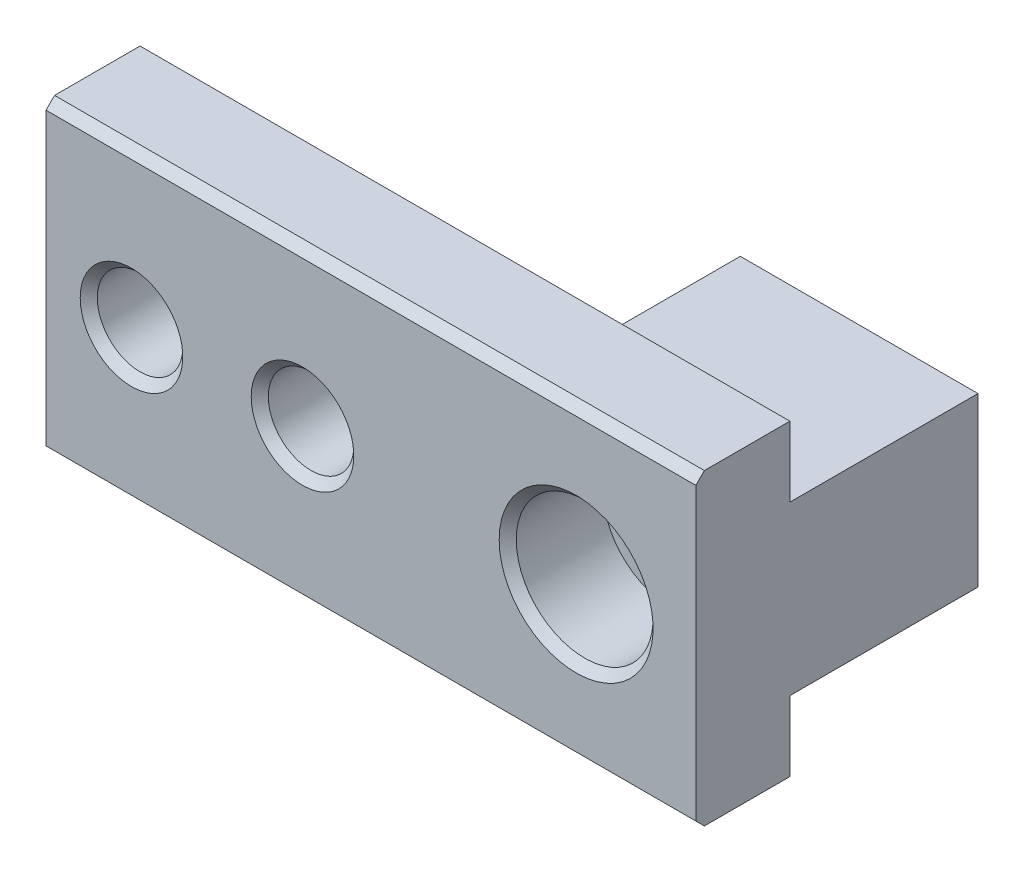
ISO-10303-21;
HEADER;
FILE_DESCRIPTION(('STEP AP214'),'2;1');
FILE_NAME('part.step','',(''),(''),'','','');
FILE_SCHEMA(('AUTOMOTIVE_DESIGN { 1 0 10303 214 1 1 1 1 }'));
ENDSEC;
DATA;
#1=APPLICATION_CONTEXT('core data for automotive mechanical design processes');
#2=APPLICATION_PROTOCOL_DEFINITION('international standard','automotive_design',2000,#1);
#3=PRODUCT_CONTEXT('',#1,'mechanical');
#4=PRODUCT('Part','Part','',(#3));
#5=PRODUCT_RELATED_PRODUCT_CATEGORY('part','',(#4));
#6=PRODUCT_DEFINITION_FORMATION('','',#4);
#7=PRODUCT_DEFINITION_CONTEXT('part definition',#1,'design');
#8=PRODUCT_DEFINITION('design','',#6,#7);
#9=PRODUCT_DEFINITION_SHAPE('','',#8);
#10=(LENGTH_UNIT() NAMED_UNIT(*) SI_UNIT(.MILLI.,.METRE.));
#11=(NAMED_UNIT(*) PLANE_ANGLE_UNIT() SI_UNIT($,.RADIAN.));
#12=(NAMED_UNIT(*) SI_UNIT($,.STERADIAN.) SOLID_ANGLE_UNIT());
#13=UNCERTAINTY_MEASURE_WITH_UNIT(LENGTH_MEASURE(1.E-05),#10,'distance_accuracy_value','');
#14=(GEOMETRIC_REPRESENTATION_CONTEXT(3) GLOBAL_UNCERTAINTY_ASSIGNED_CONTEXT((#13)) GLOBAL_UNIT_ASSIGNED_CONTEXT((#10,
#11,#12)) REPRESENTATION_CONTEXT('',''));
#15=CARTESIAN_POINT('',(0.,0.,0.));
#16=DIRECTION('',(0.,0.,1.));
#17=DIRECTION('',(1.,0.,0.));
#18=AXIS2_PLACEMENT_3D('',#15,#16,#17);
#19=CARTESIAN_POINT('',(0.,0.,-0.0599999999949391));
#20=DIRECTION('',(0.,0.,1.));
#21=DIRECTION('',(-1.,0.,0.));
#22=AXIS2_PLACEMENT_3D('',#19,#20,#21);
#23=CONICAL_SURFACE('',#22,3.02499999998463,1.17809724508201);
#24=CARTESIAN_POINT('',(0.,0.,-0.0703553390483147));
#25=DIRECTION('',(0.,0.,1.));
#26=DIRECTION('',(1.,0.,0.));
#27=AXIS2_PLACEMENT_3D('',#24,#25,#26);
#28=CIRCLE('',#27,3.);
#29=CARTESIAN_POINT('',(3.,0.,-0.0703553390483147));
#30=VERTEX_POINT('',#29);
#31=EDGE_CURVE('E348',#30,#30,#28,.F.);
#32=ORIENTED_EDGE('',*,*,#31,.T.);
#33=EDGE_LOOP('',(#32));
#34=FACE_BOUND('',#33,.T.);
#35=CARTESIAN_POINT('',(0.,0.,-0.059999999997));
#36=DIRECTION('',(0.,0.,1.));
#37=DIRECTION('',(-1.,0.,0.));
#38=AXIS2_PLACEMENT_3D('',#35,#36,#37);
#39=CIRCLE('',#38,3.02499999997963);
#40=CARTESIAN_POINT('',(-3.02499999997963,0.,-0.059999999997));
#41=VERTEX_POINT('',#40);
#42=EDGE_CURVE('E155',#41,#41,#39,.F.);
#43=ORIENTED_EDGE('',*,*,#42,.F.);
#44=EDGE_LOOP('',(#43));
#45=FACE_BOUND('',#44,.T.);
#46=ADVANCED_FACE('F14',(#34,#45),#23,.F.);
#47=CARTESIAN_POINT('',(0.,0.,-0.0599999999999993));
#48=DIRECTION('',(0.,0.,1.));
#49=DIRECTION('',(-1.,0.,0.));
#50=AXIS2_PLACEMENT_3D('',#47,#48,#49);
#51=PLANE('',#50);
#52=CARTESIAN_POINT('',(0.,0.,-0.0599999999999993));
#53=DIRECTION('',(0.,0.,1.));
#54=DIRECTION('',(-1.,0.,0.));
#55=AXIS2_PLACEMENT_3D('',#52,#53,#54);
#56=CIRCLE('',#55,4.);
#57=CARTESIAN_POINT('',(-4.,0.,-0.0599999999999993));
#58=VERTEX_POINT('',#57);
#59=EDGE_CURVE('E146',#58,#58,#56,.T.);
#60=ORIENTED_EDGE('',*,*,#59,.T.);
#61=EDGE_LOOP('',(#60));
#62=FACE_BOUND('',#61,.T.);
#63=ORIENTED_EDGE('',*,*,#42,.T.);
#64=EDGE_LOOP('',(#63));
#65=FACE_BOUND('',#64,.T.);
#66=ADVANCED_FACE('F271',(#62,#65),#51,.T.);
#67=CARTESIAN_POINT('',(0.,0.,-0.0599999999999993));
#68=DIRECTION('',(0.,0.,1.));
#69=DIRECTION('',(-1.,0.,0.));
#70=AXIS2_PLACEMENT_3D('',#67,#68,#69);
#71=CYLINDRICAL_SURFACE('',#70,4.);
#72=CARTESIAN_POINT('',(0.,0.,5.00000000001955));
#73=DIRECTION('',(0.,0.,1.));
#74=DIRECTION('',(-1.,0.,0.));
#75=AXIS2_PLACEMENT_3D('',#72,#73,#74);
#76=CIRCLE('',#75,4.00000000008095);
#77=CARTESIAN_POINT('',(-4.00000000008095,0.,5.00000000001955));
#78=VERTEX_POINT('',#77);
#79=EDGE_CURVE('E126',#78,#78,#76,.T.);
#80=ORIENTED_EDGE('',*,*,#79,.T.);
#81=EDGE_LOOP('',(#80));
#82=FACE_BOUND('',#81,.T.);
#83=ORIENTED_EDGE('',*,*,#59,.F.);
#84=EDGE_LOOP('',(#83));
#85=FACE_BOUND('',#84,.T.);
#86=ADVANCED_FACE('F267',(#82,#85),#71,.F.);
#87=CARTESIAN_POINT('',(-7.1,4.9,-11.));
#88=DIRECTION('',(0.,0.,1.));
#89=DIRECTION('',(-1.,0.,0.));
#90=AXIS2_PLACEMENT_3D('',#87,#88,#89);
#91=PLANE('',#90);
#92=CARTESIAN_POINT('',(0.,0.,-11.));
#93=DIRECTION('',(0.,0.,1.));
#94=DIRECTION('',(1.,0.,0.));
#95=AXIS2_PLACEMENT_3D('',#92,#93,#94);
#96=CIRCLE('',#95,3.51035533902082);
#97=CARTESIAN_POINT('',(3.51035533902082,0.,-11.));
#98=VERTEX_POINT('',#97);
#99=EDGE_CURVE('E189',#98,#98,#96,.T.);
#100=ORIENTED_EDGE('',*,*,#99,.T.);
#101=EDGE_LOOP('',(#100));
#102=FACE_BOUND('',#101,.T.);
#103=DIRECTION('',(-1.,0.,0.));
#104=VECTOR('',#103,1.);
#105=CARTESIAN_POINT('',(-7.1,-4.9,-11.));
#106=LINE('',#105,#104);
#107=CARTESIAN_POINT('',(7.,-4.9,-11.));
#108=VERTEX_POINT('',#107);
#109=CARTESIAN_POINT('',(-6.9,-4.9,-11.));
#110=VERTEX_POINT('',#109);
#111=EDGE_CURVE('E137',#108,#110,#106,.T.);
#112=ORIENTED_EDGE('',*,*,#111,.T.);
#113=DIRECTION('',(0.,-1.,0.));
#114=VECTOR('',#113,1.);
#115=CARTESIAN_POINT('',(-6.9,10.8813880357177,-11.));
#116=LINE('',#115,#114);
#117=CARTESIAN_POINT('',(-6.9,4.9,-11.));
#118=VERTEX_POINT('',#117);
#119=EDGE_CURVE('E315',#118,#110,#116,.T.);
#120=ORIENTED_EDGE('',*,*,#119,.F.);
#121=DIRECTION('',(1.,0.,0.));
#122=VECTOR('',#121,1.);
#123=CARTESIAN_POINT('',(-7.1,4.9,-11.));
#124=LINE('',#123,#122);
#125=CARTESIAN_POINT('',(7.,4.9,-11.));
#126=VERTEX_POINT('',#125);
#127=EDGE_CURVE('E142',#118,#126,#124,.T.);
#128=ORIENTED_EDGE('',*,*,#127,.T.);
#129=DIRECTION('',(0.,1.,0.));
#130=VECTOR('',#129,1.);
#131=CARTESIAN_POINT('',(7.,4.9,-11.));
#132=LINE('',#131,#130);
#133=EDGE_CURVE('E128',#108,#126,#132,.T.);
#134=ORIENTED_EDGE('',*,*,#133,.F.);
#135=EDGE_LOOP('',(#112,#120,#128,#134));
#136=FACE_BOUND('',#135,.T.);
#137=ADVANCED_FACE('F263',(#102,#136),#91,.F.);
#138=CARTESIAN_POINT('',(-7.1,9.05,0.));
#139=DIRECTION('',(0.,0.,1.));
#140=DIRECTION('',(-1.,0.,0.));
#141=AXIS2_PLACEMENT_3D('',#138,#139,#140);
#142=PLANE('',#141);
#143=DIRECTION('',(0.,1.,0.));
#144=VECTOR('',#143,1.);
#145=CARTESIAN_POINT('',(-31.,9.05,0.));
#146=LINE('',#145,#144);
#147=CARTESIAN_POINT('',(-31.,4.9,0.));
#148=VERTEX_POINT('',#147);
#149=CARTESIAN_POINT('',(-31.,9.,0.));
#150=VERTEX_POINT('',#149);
#151=EDGE_CURVE('E331',#148,#150,#146,.T.);
#152=ORIENTED_EDGE('',*,*,#151,.T.);
#153=DIRECTION('',(1.,0.,0.));
#154=VECTOR('',#153,1.);
#155=CARTESIAN_POINT('',(-7.1,9.,0.));
#156=LINE('',#155,#154);
#157=CARTESIAN_POINT('',(7.,9.,0.));
#158=VERTEX_POINT('',#157);
#159=EDGE_CURVE('E351',#150,#158,#156,.T.);
#160=ORIENTED_EDGE('',*,*,#159,.T.);
#161=DIRECTION('',(0.,1.,0.));
#162=VECTOR('',#161,1.);
#163=CARTESIAN_POINT('',(7.,4.9,0.));
#164=LINE('',#163,#162);
#165=CARTESIAN_POINT('',(7.,4.9,0.));
#166=VERTEX_POINT('',#165);
#167=EDGE_CURVE('E152',#166,#158,#164,.T.);
#168=ORIENTED_EDGE('',*,*,#167,.F.);
#169=DIRECTION('',(1.,0.,0.));
#170=VECTOR('',#169,1.);
#171=CARTESIAN_POINT('',(-7.1,4.9,0.));
#172=LINE('',#171,#170);
#173=EDGE_CURVE('E144',#166,#148,#172,.F.);
#174=ORIENTED_EDGE('',*,*,#173,.T.);
#175=EDGE_LOOP('',(#152,#160,#168,#174));
#176=FACE_BOUND('',#175,.T.);
#177=ADVANCED_FACE('F259',(#176),#142,.F.);
#178=CARTESIAN_POINT('',(-7.1,4.9,-11.));
#179=DIRECTION('',(0.,-1.,0.));
#180=DIRECTION('',(1.,0.,0.));
#181=AXIS2_PLACEMENT_3D('',#178,#179,#180);
#182=PLANE('',#181);
#183=DIRECTION('',(0.,0.,1.));
#184=VECTOR('',#183,1.);
#185=CARTESIAN_POINT('',(-6.9,4.9,-11.));
#186=LINE('',#185,#184);
#187=CARTESIAN_POINT('',(-6.9,4.9,-2.5));
#188=VERTEX_POINT('',#187);
#189=EDGE_CURVE('E342',#118,#188,#186,.T.);
#190=ORIENTED_EDGE('',*,*,#189,.T.);
#191=DIRECTION('',(-1.,0.,0.));
#192=VECTOR('',#191,1.);
#193=CARTESIAN_POINT('',(-31.1,4.9,-2.5));
#194=LINE('',#193,#192);
#195=CARTESIAN_POINT('',(-31.,4.9,-2.5));
#196=VERTEX_POINT('',#195);
#197=EDGE_CURVE('E140',#188,#196,#194,.T.);
#198=ORIENTED_EDGE('',*,*,#197,.T.);
#199=DIRECTION('',(0.,0.,1.));
#200=VECTOR('',#199,1.);
#201=CARTESIAN_POINT('',(-31.,4.9,-11.));
#202=LINE('',#201,#200);
#203=EDGE_CURVE('E158',#196,#148,#202,.T.);
#204=ORIENTED_EDGE('',*,*,#203,.T.);
#205=ORIENTED_EDGE('',*,*,#173,.F.);
#206=DIRECTION('',(0.,0.,1.));
#207=VECTOR('',#206,1.);
#208=CARTESIAN_POINT('',(7.,4.9,-11.));
#209=LINE('',#208,#207);
#210=EDGE_CURVE('E322',#126,#166,#209,.T.);
#211=ORIENTED_EDGE('',*,*,#210,.F.);
#212=ORIENTED_EDGE('',*,*,#127,.F.);
#213=EDGE_LOOP('',(#190,#198,#204,#205,#211,#212));
#214=FACE_BOUND('',#213,.T.);
#215=ADVANCED_FACE('F255',(#214),#182,.F.);
#216=CARTESIAN_POINT('',(-31.1,4.9,-2.5));
#217=DIRECTION('',(0.,0.,1.));
#218=DIRECTION('',(-1.,0.,0.));
#219=AXIS2_PLACEMENT_3D('',#216,#217,#218);
#220=PLANE('',#219);
#221=CARTESIAN_POINT('',(-16.,0.,-2.5));
#222=DIRECTION('',(0.,0.,1.));
#223=DIRECTION('',(1.,0.,0.));
#224=AXIS2_PLACEMENT_3D('',#221,#222,#223);
#225=CIRCLE('',#224,3.);
#226=CARTESIAN_POINT('',(-13.,0.,-2.5));
#227=VERTEX_POINT('',#226);
#228=EDGE_CURVE('E165',#227,#227,#225,.T.);
#229=ORIENTED_EDGE('',*,*,#228,.T.);
#230=EDGE_LOOP('',(#229));
#231=FACE_BOUND('',#230,.T.);
#232=CARTESIAN_POINT('',(-26.,0.,-2.5));
#233=DIRECTION('',(0.,0.,1.));
#234=DIRECTION('',(1.,0.,0.));
#235=AXIS2_PLACEMENT_3D('',#232,#233,#234);
#236=CIRCLE('',#235,3.);
#237=CARTESIAN_POINT('',(-23.,0.,-2.5));
#238=VERTEX_POINT('',#237);
#239=EDGE_CURVE('E162',#238,#238,#236,.T.);
#240=ORIENTED_EDGE('',*,*,#239,.T.);
#241=EDGE_LOOP('',(#240));
#242=FACE_BOUND('',#241,.T.);
#243=DIRECTION('',(0.,-1.,0.));
#244=VECTOR('',#243,1.);
#245=CARTESIAN_POINT('',(-31.,12.1632253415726,-2.5));
#246=LINE('',#245,#244);
#247=CARTESIAN_POINT('',(-31.,-4.9,-2.5));
#248=VERTEX_POINT('',#247);
#249=EDGE_CURVE('E339',#196,#248,#246,.T.);
#250=ORIENTED_EDGE('',*,*,#249,.F.);
#251=ORIENTED_EDGE('',*,*,#197,.F.);
#252=DIRECTION('',(0.,-1.,0.));
#253=VECTOR('',#252,1.);
#254=CARTESIAN_POINT('',(-6.9,10.8813880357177,-2.5));
#255=LINE('',#254,#253);
#256=CARTESIAN_POINT('',(-6.9,-4.9,-2.5));
#257=VERTEX_POINT('',#256);
#258=EDGE_CURVE('E344',#188,#257,#255,.T.);
#259=ORIENTED_EDGE('',*,*,#258,.T.);
#260=DIRECTION('',(-1.,0.,0.));
#261=VECTOR('',#260,1.);
#262=CARTESIAN_POINT('',(-7.1,-4.9,-2.5));
#263=LINE('',#262,#261);
#264=EDGE_CURVE('E135',#257,#248,#263,.T.);
#265=ORIENTED_EDGE('',*,*,#264,.T.);
#266=EDGE_LOOP('',(#250,#251,#259,#265));
#267=FACE_BOUND('',#266,.T.);
#268=ADVANCED_FACE('F251',(#231,#242,#267),#220,.F.);
#269=CARTESIAN_POINT('',(-7.1,-4.9,-11.));
#270=DIRECTION('',(0.,1.,0.));
#271=DIRECTION('',(-1.,0.,0.));
#272=AXIS2_PLACEMENT_3D('',#269,#270,#271);
#273=PLANE('',#272);
#274=ORIENTED_EDGE('',*,*,#264,.F.);
#275=DIRECTION('',(0.,0.,-1.));
#276=VECTOR('',#275,1.);
#277=CARTESIAN_POINT('',(-6.9,-4.9,-11.));
#278=LINE('',#277,#276);
#279=EDGE_CURVE('E186',#257,#110,#278,.T.);
#280=ORIENTED_EDGE('',*,*,#279,.T.);
#281=ORIENTED_EDGE('',*,*,#111,.F.);
#282=DIRECTION('',(0.,0.,1.));
#283=VECTOR('',#282,1.);
#284=CARTESIAN_POINT('',(7.,-4.9,-11.));
#285=LINE('',#284,#283);
#286=CARTESIAN_POINT('',(7.,-4.9,0.));
#287=VERTEX_POINT('',#286);
#288=EDGE_CURVE('E125',#287,#108,#285,.F.);
#289=ORIENTED_EDGE('',*,*,#288,.F.);
#290=DIRECTION('',(-1.,0.,0.));
#291=VECTOR('',#290,1.);
#292=CARTESIAN_POINT('',(-7.1,-4.9,0.));
#293=LINE('',#292,#291);
#294=CARTESIAN_POINT('',(-31.,-4.9,0.));
#295=VERTEX_POINT('',#294);
#296=EDGE_CURVE('E123',#287,#295,#293,.T.);
#297=ORIENTED_EDGE('',*,*,#296,.T.);
#298=DIRECTION('',(0.,0.,-1.));
#299=VECTOR('',#298,1.);
#300=CARTESIAN_POINT('',(-31.,-4.9,-11.));
#301=LINE('',#300,#299);
#302=EDGE_CURVE('E334',#295,#248,#301,.T.);
#303=ORIENTED_EDGE('',*,*,#302,.T.);
#304=EDGE_LOOP('',(#274,#280,#281,#289,#297,#303));
#305=FACE_BOUND('',#304,.T.);
#306=ADVANCED_FACE('F248',(#305),#273,.F.);
#307=CARTESIAN_POINT('',(-7.1,-4.9,0.));
#308=DIRECTION('',(0.,0.,1.));
#309=DIRECTION('',(-1.,0.,0.));
#310=AXIS2_PLACEMENT_3D('',#307,#308,#309);
#311=PLANE('',#310);
#312=ORIENTED_EDGE('',*,*,#296,.F.);
#313=DIRECTION('',(0.,1.,0.));
#314=VECTOR('',#313,1.);
#315=CARTESIAN_POINT('',(7.,4.9,0.));
#316=LINE('',#315,#314);
#317=CARTESIAN_POINT('',(7.,-9.,0.));
#318=VERTEX_POINT('',#317);
#319=EDGE_CURVE('E117',#318,#287,#316,.T.);
#320=ORIENTED_EDGE('',*,*,#319,.F.);
#321=DIRECTION('',(-1.,0.,0.));
#322=VECTOR('',#321,1.);
#323=CARTESIAN_POINT('',(-7.1,-9.,0.));
#324=LINE('',#323,#322);
#325=CARTESIAN_POINT('',(-31.,-9.,0.));
#326=VERTEX_POINT('',#325);
#327=EDGE_CURVE('E103',#318,#326,#324,.T.);
#328=ORIENTED_EDGE('',*,*,#327,.T.);
#329=DIRECTION('',(0.,1.,0.));
#330=VECTOR('',#329,1.);
#331=CARTESIAN_POINT('',(-31.,-4.9,0.));
#332=LINE('',#331,#330);
#333=EDGE_CURVE('E337',#326,#295,#332,.T.);
#334=ORIENTED_EDGE('',*,*,#333,.T.);
#335=EDGE_LOOP('',(#312,#320,#328,#334));
#336=FACE_BOUND('',#335,.T.);
#337=ADVANCED_FACE('F121',(#336),#311,.F.);
#338=CARTESIAN_POINT('',(0.,0.,5.4999999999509));
#339=DIRECTION('',(0.,0.,1.));
#340=DIRECTION('',(-1.,0.,0.));
#341=AXIS2_PLACEMENT_3D('',#338,#339,#340);
#342=CONICAL_SURFACE('',#341,4.50000000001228,0.785398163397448);
#343=CARTESIAN_POINT('',(0.,0.,5.4999999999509));
#344=DIRECTION('',(0.,0.,1.));
#345=DIRECTION('',(-1.,0.,0.));
#346=AXIS2_PLACEMENT_3D('',#343,#344,#345);
#347=CIRCLE('',#346,4.50000000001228);
#348=CARTESIAN_POINT('',(-4.50000000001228,0.,5.4999999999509));
#349=VERTEX_POINT('',#348);
#350=EDGE_CURVE('E148',#349,#349,#347,.T.);
#351=ORIENTED_EDGE('',*,*,#350,.T.);
#352=EDGE_LOOP('',(#351));
#353=FACE_BOUND('',#352,.T.);
#354=ORIENTED_EDGE('',*,*,#79,.F.);
#355=EDGE_LOOP('',(#354));
#356=FACE_BOUND('',#355,.T.);
#357=ADVANCED_FACE('F238',(#353,#356),#342,.F.);
#358=CARTESIAN_POINT('',(7.,4.9,-11.));
#359=DIRECTION('',(1.,0.,0.));
#360=DIRECTION('',(0.,1.,0.));
#361=AXIS2_PLACEMENT_3D('',#358,#359,#360);
#362=PLANE('',#361);
#363=DIRECTION('',(0.,-1.,0.));
#364=VECTOR('',#363,1.);
#365=CARTESIAN_POINT('',(7.,9.05,5.5));
#366=LINE('',#365,#364);
#367=CARTESIAN_POINT('',(7.,8.5,5.5));
#368=VERTEX_POINT('',#367);
#369=CARTESIAN_POINT('',(7.,-8.5,5.5));
#370=VERTEX_POINT('',#369);
#371=EDGE_CURVE('E151',#368,#370,#366,.T.);
#372=ORIENTED_EDGE('',*,*,#371,.T.);
#373=DIRECTION('',(0.,0.707106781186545,0.70710678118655));
#374=VECTOR('',#373,1.);
#375=CARTESIAN_POINT('',(7.,-10.05,3.94999999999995));
#376=LINE('',#375,#374);
#377=CARTESIAN_POINT('',(7.,-9.,5.));
#378=VERTEX_POINT('',#377);
#379=EDGE_CURVE('E119',#370,#378,#376,.F.);
#380=ORIENTED_EDGE('',*,*,#379,.T.);
#381=DIRECTION('',(0.,0.,1.));
#382=VECTOR('',#381,1.);
#383=CARTESIAN_POINT('',(7.,-9.,6.90252950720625));
#384=LINE('',#383,#382);
#385=EDGE_CURVE('E106',#318,#378,#384,.T.);
#386=ORIENTED_EDGE('',*,*,#385,.F.);
#387=ORIENTED_EDGE('',*,*,#319,.T.);
#388=ORIENTED_EDGE('',*,*,#288,.T.);
#389=ORIENTED_EDGE('',*,*,#133,.T.);
#390=ORIENTED_EDGE('',*,*,#210,.T.);
#391=ORIENTED_EDGE('',*,*,#167,.T.);
#392=DIRECTION('',(0.,0.,-1.));
#393=VECTOR('',#392,1.);
#394=CARTESIAN_POINT('',(7.,9.,5.74816269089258));
#395=LINE('',#394,#393);
#396=CARTESIAN_POINT('',(7.,9.,5.));
#397=VERTEX_POINT('',#396);
#398=EDGE_CURVE('E111',#397,#158,#395,.T.);
#399=ORIENTED_EDGE('',*,*,#398,.F.);
#400=DIRECTION('',(0.,0.707106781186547,-0.707106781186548));
#401=VECTOR('',#400,1.);
#402=CARTESIAN_POINT('',(7.,14.95,-0.95));
#403=LINE('',#402,#401);
#404=EDGE_CURVE('E203',#397,#368,#403,.F.);
#405=ORIENTED_EDGE('',*,*,#404,.T.);
#406=EDGE_LOOP('',(#372,#380,#386,#387,#388,#389,#390,#391,#399,#405));
#407=FACE_BOUND('',#406,.T.);
#408=ADVANCED_FACE('F115',(#407),#362,.T.);
#409=CARTESIAN_POINT('',(-7.1,9.05,5.5));
#410=DIRECTION('',(0.,0.,-1.));
#411=DIRECTION('',(1.,0.,0.));
#412=AXIS2_PLACEMENT_3D('',#409,#410,#411);
#413=PLANE('',#412);
#414=CARTESIAN_POINT('',(-16.,0.,5.5));
#415=DIRECTION('',(0.,0.,-1.));
#416=DIRECTION('',(-1.,0.,0.));
#417=AXIS2_PLACEMENT_3D('',#414,#415,#416);
#418=CIRCLE('',#417,3.);
#419=CARTESIAN_POINT('',(-19.,0.,5.5));
#420=VERTEX_POINT('',#419);
#421=EDGE_CURVE('E177',#420,#420,#418,.T.);
#422=ORIENTED_EDGE('',*,*,#421,.T.);
#423=EDGE_LOOP('',(#422));
#424=FACE_BOUND('',#423,.T.);
#425=CARTESIAN_POINT('',(-26.,0.,5.5));
#426=DIRECTION('',(0.,0.,-1.));
#427=DIRECTION('',(-1.,0.,0.));
#428=AXIS2_PLACEMENT_3D('',#425,#426,#427);
#429=CIRCLE('',#428,3.);
#430=CARTESIAN_POINT('',(-29.,0.,5.5));
#431=VERTEX_POINT('',#430);
#432=EDGE_CURVE('E174',#431,#431,#429,.T.);
#433=ORIENTED_EDGE('',*,*,#432,.T.);
#434=EDGE_LOOP('',(#433));
#435=FACE_BOUND('',#434,.T.);
#436=DIRECTION('',(0.,-1.,0.));
#437=VECTOR('',#436,1.);
#438=CARTESIAN_POINT('',(-31.,9.05,5.5));
#439=LINE('',#438,#437);
#440=CARTESIAN_POINT('',(-31.,8.5,5.5));
#441=VERTEX_POINT('',#440);
#442=CARTESIAN_POINT('',(-31.,-8.5,5.5));
#443=VERTEX_POINT('',#442);
#444=EDGE_CURVE('E159',#441,#443,#439,.T.);
#445=ORIENTED_EDGE('',*,*,#444,.T.);
#446=DIRECTION('',(1.,0.,0.));
#447=VECTOR('',#446,1.);
#448=CARTESIAN_POINT('',(-7.1,-8.5,5.5));
#449=LINE('',#448,#447);
#450=EDGE_CURVE('E200',#443,#370,#449,.T.);
#451=ORIENTED_EDGE('',*,*,#450,.T.);
#452=ORIENTED_EDGE('',*,*,#371,.F.);
#453=DIRECTION('',(-1.,0.,0.));
#454=VECTOR('',#453,1.);
#455=CARTESIAN_POINT('',(-7.1,8.5,5.5));
#456=LINE('',#455,#454);
#457=EDGE_CURVE('E198',#368,#441,#456,.T.);
#458=ORIENTED_EDGE('',*,*,#457,.T.);
#459=EDGE_LOOP('',(#445,#451,#452,#458));
#460=FACE_BOUND('',#459,.T.);
#461=ORIENTED_EDGE('',*,*,#350,.F.);
#462=EDGE_LOOP('',(#461));
#463=FACE_BOUND('',#462,.T.);
#464=ADVANCED_FACE('F212',(#424,#435,#460,#463),#413,.F.);
#465=CARTESIAN_POINT('',(-31.,12.1632253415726,7.5));
#466=DIRECTION('',(1.,0.,0.));
#467=DIRECTION('',(0.,1.,0.));
#468=AXIS2_PLACEMENT_3D('',#465,#466,#467);
#469=PLANE('',#468);
#470=DIRECTION('',(0.,0.,1.));
#471=VECTOR('',#470,1.);
#472=CARTESIAN_POINT('',(-31.,-9.,7.5));
#473=LINE('',#472,#471);
#474=CARTESIAN_POINT('',(-31.,-9.,5.));
#475=VERTEX_POINT('',#474);
#476=EDGE_CURVE('E107',#326,#475,#473,.T.);
#477=ORIENTED_EDGE('',*,*,#476,.T.);
#478=DIRECTION('',(0.,-0.707106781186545,-0.70710678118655));
#479=VECTOR('',#478,1.);
#480=CARTESIAN_POINT('',(-31.,-8.5,5.5));
#481=LINE('',#480,#479);
#482=EDGE_CURVE('E22',#475,#443,#481,.F.);
#483=ORIENTED_EDGE('',*,*,#482,.T.);
#484=ORIENTED_EDGE('',*,*,#444,.F.);
#485=DIRECTION('',(0.,-0.707106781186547,0.707106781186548));
#486=VECTOR('',#485,1.);
#487=CARTESIAN_POINT('',(-31.,9.,5.));
#488=LINE('',#487,#486);
#489=CARTESIAN_POINT('',(-31.,9.,5.));
#490=VERTEX_POINT('',#489);
#491=EDGE_CURVE('E29',#441,#490,#488,.F.);
#492=ORIENTED_EDGE('',*,*,#491,.T.);
#493=DIRECTION('',(0.,0.,-1.));
#494=VECTOR('',#493,1.);
#495=CARTESIAN_POINT('',(-31.,9.,7.5));
#496=LINE('',#495,#494);
#497=EDGE_CURVE('E195',#490,#150,#496,.T.);
#498=ORIENTED_EDGE('',*,*,#497,.T.);
#499=ORIENTED_EDGE('',*,*,#151,.F.);
#500=ORIENTED_EDGE('',*,*,#203,.F.);
#501=ORIENTED_EDGE('',*,*,#249,.T.);
#502=ORIENTED_EDGE('',*,*,#302,.F.);
#503=ORIENTED_EDGE('',*,*,#333,.F.);
#504=EDGE_LOOP('',(#477,#483,#484,#492,#498,#499,#500,#501,#502,#503));
#505=FACE_BOUND('',#504,.T.);
#506=ADVANCED_FACE('F208',(#505),#469,.F.);
#507=CARTESIAN_POINT('',(-26.,0.,-4.5));
#508=DIRECTION('',(0.,0.,1.));
#509=DIRECTION('',(1.,0.,0.));
#510=AXIS2_PLACEMENT_3D('',#507,#508,#509);
#511=CYLINDRICAL_SURFACE('',#510,2.5);
#512=CARTESIAN_POINT('',(-26.,0.,-2.));
#513=DIRECTION('',(0.,0.,1.));
#514=DIRECTION('',(1.,0.,0.));
#515=AXIS2_PLACEMENT_3D('',#512,#513,#514);
#516=CIRCLE('',#515,2.5);
#517=CARTESIAN_POINT('',(-23.5,0.,-2.));
#518=VERTEX_POINT('',#517);
#519=EDGE_CURVE('E183',#518,#518,#516,.F.);
#520=ORIENTED_EDGE('',*,*,#519,.T.);
#521=EDGE_LOOP('',(#520));
#522=FACE_BOUND('',#521,.T.);
#523=CARTESIAN_POINT('',(-26.,0.,5.));
#524=DIRECTION('',(0.,0.,-1.));
#525=DIRECTION('',(-1.,0.,0.));
#526=AXIS2_PLACEMENT_3D('',#523,#524,#525);
#527=CIRCLE('',#526,2.5);
#528=CARTESIAN_POINT('',(-28.5,0.,5.));
#529=VERTEX_POINT('',#528);
#530=EDGE_CURVE('E180',#529,#529,#527,.F.);
#531=ORIENTED_EDGE('',*,*,#530,.T.);
#532=EDGE_LOOP('',(#531));
#533=FACE_BOUND('',#532,.T.);
#534=ADVANCED_FACE('F236',(#522,#533),#511,.F.);
#535=CARTESIAN_POINT('',(-16.,0.,-4.5));
#536=DIRECTION('',(0.,0.,1.));
#537=DIRECTION('',(1.,0.,0.));
#538=AXIS2_PLACEMENT_3D('',#535,#536,#537);
#539=CYLINDRICAL_SURFACE('',#538,2.5);
#540=CARTESIAN_POINT('',(-16.,0.,-2.));
#541=DIRECTION('',(0.,0.,1.));
#542=DIRECTION('',(1.,0.,0.));
#543=AXIS2_PLACEMENT_3D('',#540,#541,#542);
#544=CIRCLE('',#543,2.5);
#545=CARTESIAN_POINT('',(-13.5,0.,-2.));
#546=VERTEX_POINT('',#545);
#547=EDGE_CURVE('E171',#546,#546,#544,.F.);
#548=ORIENTED_EDGE('',*,*,#547,.T.);
#549=EDGE_LOOP('',(#548));
#550=FACE_BOUND('',#549,.T.);
#551=CARTESIAN_POINT('',(-16.,0.,5.));
#552=DIRECTION('',(0.,0.,-1.));
#553=DIRECTION('',(-1.,0.,0.));
#554=AXIS2_PLACEMENT_3D('',#551,#552,#553);
#555=CIRCLE('',#554,2.5);
#556=CARTESIAN_POINT('',(-18.5,0.,5.));
#557=VERTEX_POINT('',#556);
#558=EDGE_CURVE('E168',#557,#557,#555,.F.);
#559=ORIENTED_EDGE('',*,*,#558,.T.);
#560=EDGE_LOOP('',(#559));
#561=FACE_BOUND('',#560,.T.);
#562=ADVANCED_FACE('F283',(#550,#561),#539,.F.);
#563=CARTESIAN_POINT('',(-16.,0.,-2.5));
#564=DIRECTION('',(0.,0.,-1.));
#565=DIRECTION('',(-1.,0.,0.));
#566=AXIS2_PLACEMENT_3D('',#563,#564,#565);
#567=CONICAL_SURFACE('',#566,3.,0.785398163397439);
#568=ORIENTED_EDGE('',*,*,#547,.F.);
#569=EDGE_LOOP('',(#568));
#570=FACE_BOUND('',#569,.T.);
#571=ORIENTED_EDGE('',*,*,#228,.F.);
#572=EDGE_LOOP('',(#571));
#573=FACE_BOUND('',#572,.T.);
#574=ADVANCED_FACE('F279',(#570,#573),#567,.F.);
#575=CARTESIAN_POINT('',(-16.,0.,5.));
#576=DIRECTION('',(0.,0.,1.));
#577=DIRECTION('',(1.,0.,0.));
#578=AXIS2_PLACEMENT_3D('',#575,#576,#577);
#579=CONICAL_SURFACE('',#578,2.5,0.785398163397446);
#580=ORIENTED_EDGE('',*,*,#421,.F.);
#581=EDGE_LOOP('',(#580));
#582=FACE_BOUND('',#581,.T.);
#583=ORIENTED_EDGE('',*,*,#558,.F.);
#584=EDGE_LOOP('',(#583));
#585=FACE_BOUND('',#584,.T.);
#586=ADVANCED_FACE('F282',(#582,#585),#579,.F.);
#587=CARTESIAN_POINT('',(-26.,0.,-2.5));
#588=DIRECTION('',(0.,0.,-1.));
#589=DIRECTION('',(-1.,0.,0.));
#590=AXIS2_PLACEMENT_3D('',#587,#588,#589);
#591=CONICAL_SURFACE('',#590,3.,0.785398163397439);
#592=ORIENTED_EDGE('',*,*,#519,.F.);
#593=EDGE_LOOP('',(#592));
#594=FACE_BOUND('',#593,.T.);
#595=ORIENTED_EDGE('',*,*,#239,.F.);
#596=EDGE_LOOP('',(#595));
#597=FACE_BOUND('',#596,.T.);
#598=ADVANCED_FACE('F287',(#594,#597),#591,.F.);
#599=CARTESIAN_POINT('',(-26.,0.,5.));
#600=DIRECTION('',(0.,0.,1.));
#601=DIRECTION('',(1.,0.,0.));
#602=AXIS2_PLACEMENT_3D('',#599,#600,#601);
#603=CONICAL_SURFACE('',#602,2.5,0.785398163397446);
#604=ORIENTED_EDGE('',*,*,#432,.F.);
#605=EDGE_LOOP('',(#604));
#606=FACE_BOUND('',#605,.T.);
#607=ORIENTED_EDGE('',*,*,#530,.F.);
#608=EDGE_LOOP('',(#607));
#609=FACE_BOUND('',#608,.T.);
#610=ADVANCED_FACE('F291',(#606,#609),#603,.F.);
#611=CARTESIAN_POINT('',(-6.9,10.8813880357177,22.3659492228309));
#612=DIRECTION('',(1.,0.,0.));
#613=DIRECTION('',(0.,1.,0.));
#614=AXIS2_PLACEMENT_3D('',#611,#612,#613);
#615=PLANE('',#614);
#616=ORIENTED_EDGE('',*,*,#119,.T.);
#617=ORIENTED_EDGE('',*,*,#279,.F.);
#618=ORIENTED_EDGE('',*,*,#258,.F.);
#619=ORIENTED_EDGE('',*,*,#189,.F.);
#620=EDGE_LOOP('',(#616,#617,#618,#619));
#621=FACE_BOUND('',#620,.T.);
#622=ADVANCED_FACE('F294',(#621),#615,.F.);
#623=CARTESIAN_POINT('',(0.,0.,5.5));
#624=DIRECTION('',(0.,0.,-1.));
#625=DIRECTION('',(-1.,0.,0.));
#626=AXIS2_PLACEMENT_3D('',#623,#624,#625);
#627=CYLINDRICAL_SURFACE('',#626,3.);
#628=CARTESIAN_POINT('',(0.,0.,-10.4896446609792));
#629=DIRECTION('',(0.,0.,1.));
#630=DIRECTION('',(1.,0.,0.));
#631=AXIS2_PLACEMENT_3D('',#628,#629,#630);
#632=CIRCLE('',#631,3.);
#633=CARTESIAN_POINT('',(3.,0.,-10.4896446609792));
#634=VERTEX_POINT('',#633);
#635=EDGE_CURVE('E192',#634,#634,#632,.F.);
#636=ORIENTED_EDGE('',*,*,#635,.T.);
#637=EDGE_LOOP('',(#636));
#638=FACE_BOUND('',#637,.T.);
#639=ORIENTED_EDGE('',*,*,#31,.F.);
#640=EDGE_LOOP('',(#639));
#641=FACE_BOUND('',#640,.T.);
#642=ADVANCED_FACE('F298',(#638,#641),#627,.F.);
#643=CARTESIAN_POINT('',(0.,0.,-11.3431980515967));
#644=DIRECTION('',(0.,0.,-1.));
#645=DIRECTION('',(-1.,0.,0.));
#646=AXIS2_PLACEMENT_3D('',#643,#644,#645);
#647=CONICAL_SURFACE('',#646,3.85355339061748,0.785398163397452);
#648=ORIENTED_EDGE('',*,*,#635,.F.);
#649=EDGE_LOOP('',(#648));
#650=FACE_BOUND('',#649,.T.);
#651=ORIENTED_EDGE('',*,*,#99,.F.);
#652=EDGE_LOOP('',(#651));
#653=FACE_BOUND('',#652,.T.);
#654=ADVANCED_FACE('F296',(#650,#653),#647,.F.);
#655=CARTESIAN_POINT('',(-31.,9.,5.74816269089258));
#656=DIRECTION('',(0.,-1.,0.));
#657=DIRECTION('',(1.,0.,0.));
#658=AXIS2_PLACEMENT_3D('',#655,#656,#657);
#659=PLANE('',#658);
#660=ORIENTED_EDGE('',*,*,#497,.F.);
#661=DIRECTION('',(1.,0.,0.));
#662=VECTOR('',#661,1.);
#663=CARTESIAN_POINT('',(-31.,9.,5.));
#664=LINE('',#663,#662);
#665=EDGE_CURVE('E9',#490,#397,#664,.T.);
#666=ORIENTED_EDGE('',*,*,#665,.T.);
#667=ORIENTED_EDGE('',*,*,#398,.T.);
#668=ORIENTED_EDGE('',*,*,#159,.F.);
#669=EDGE_LOOP('',(#660,#666,#667,#668));
#670=FACE_BOUND('',#669,.T.);
#671=ADVANCED_FACE('F225',(#670),#659,.F.);
#672=CARTESIAN_POINT('',(-31.,-9.,6.90252950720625));
#673=DIRECTION('',(0.,1.,0.));
#674=DIRECTION('',(-1.,0.,0.));
#675=AXIS2_PLACEMENT_3D('',#672,#673,#674);
#676=PLANE('',#675);
#677=ORIENTED_EDGE('',*,*,#385,.T.);
#678=DIRECTION('',(-1.,0.,0.));
#679=VECTOR('',#678,1.);
#680=CARTESIAN_POINT('',(-31.,-9.,5.));
#681=LINE('',#680,#679);
#682=EDGE_CURVE('E37',#378,#475,#681,.T.);
#683=ORIENTED_EDGE('',*,*,#682,.T.);
#684=ORIENTED_EDGE('',*,*,#476,.F.);
#685=ORIENTED_EDGE('',*,*,#327,.F.);
#686=EDGE_LOOP('',(#677,#683,#684,#685));
#687=FACE_BOUND('',#686,.T.);
#688=ADVANCED_FACE('F105',(#687),#676,.F.);
#689=CARTESIAN_POINT('',(-7.1,-8.5,5.5));
#690=DIRECTION('',(0.,0.70710678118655,-0.707106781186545));
#691=DIRECTION('',(1.,0.,0.));
#692=AXIS2_PLACEMENT_3D('',#689,#690,#691);
#693=PLANE('',#692);
#694=ORIENTED_EDGE('',*,*,#482,.F.);
#695=ORIENTED_EDGE('',*,*,#682,.F.);
#696=ORIENTED_EDGE('',*,*,#379,.F.);
#697=ORIENTED_EDGE('',*,*,#450,.F.);
#698=EDGE_LOOP('',(#694,#695,#696,#697));
#699=FACE_BOUND('',#698,.T.);
#700=ADVANCED_FACE('F216',(#699),#693,.F.);
#701=CARTESIAN_POINT('',(-31.,9.,5.));
#702=DIRECTION('',(0.,-0.707106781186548,-0.707106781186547));
#703=DIRECTION('',(1.,0.,0.));
#704=AXIS2_PLACEMENT_3D('',#701,#702,#703);
#705=PLANE('',#704);
#706=ORIENTED_EDGE('',*,*,#491,.F.);
#707=ORIENTED_EDGE('',*,*,#457,.F.);
#708=ORIENTED_EDGE('',*,*,#404,.F.);
#709=ORIENTED_EDGE('',*,*,#665,.F.);
#710=EDGE_LOOP('',(#706,#707,#708,#709));
#711=FACE_BOUND('',#710,.T.);
#712=ADVANCED_FACE('F16',(#711),#705,.F.);
#713=CLOSED_SHELL('',(#46,#66,#86,#137,#177,#215,#268,#306,#337,#357,#408,#464,#506,#534,#562,
#574,#586,#598,#610,#622,#642,#654,#671,#688,#700,#712));
#714=MANIFOLD_SOLID_BREP('B1',#713);
#715=ADVANCED_BREP_SHAPE_REPRESENTATION('',(#18,#714),#14);
#716=SHAPE_DEFINITION_REPRESENTATION(#9,#715);
ENDSEC;
END-ISO-10303-21;
